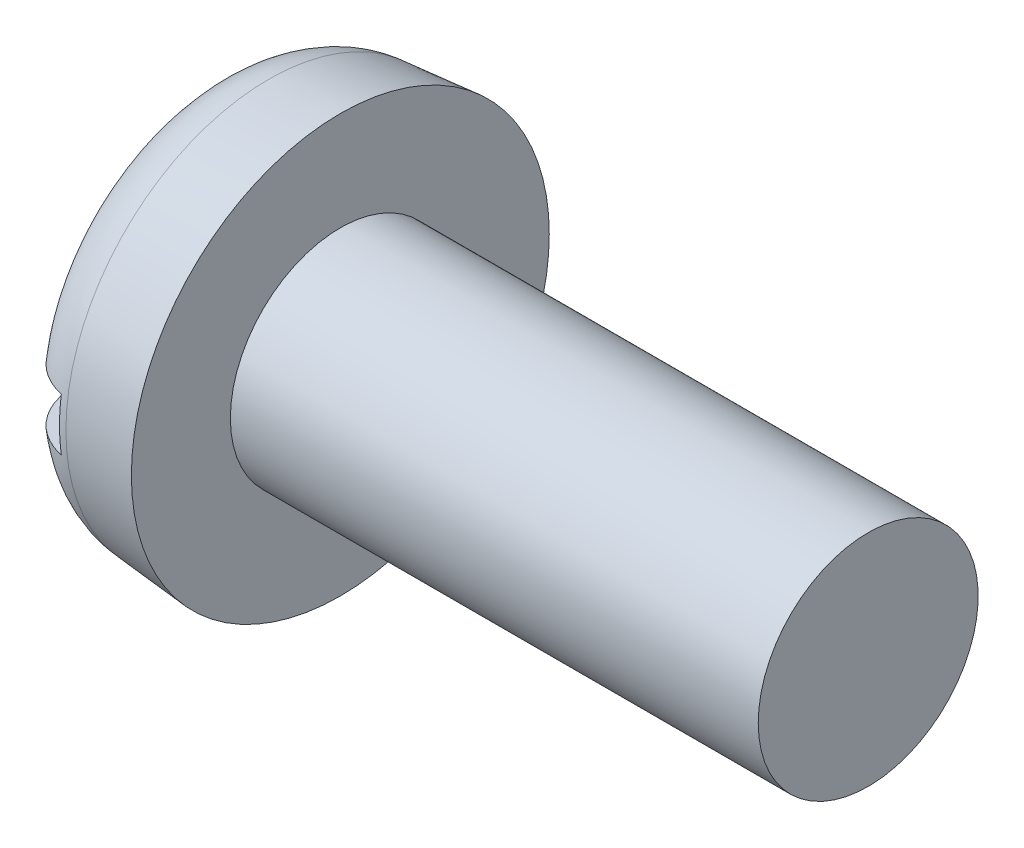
from build123d import *

# Parameters (mm, degrees)
FILLET2_R  = 1.5
SKETCH2_W  = 9.5
SKETCH2_H  = 1.2
SLOT_DEPTH = 1.2


with BuildPart() as part:
    # BodySke → Base-Revolve (revolve)
    with BuildSketch(Plane.XY, mode=Mode.PRIVATE) as base_revolve_sk:
        Polygon((3, 2.5), (3, 4.75), (0, 4.487534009), (0, 0), (15, 0), (15, 2.5), align=None)
    revolve(base_revolve_sk.sketch.rotate(Axis((-25.4, 0, 0), (1, 0, 0)), 90), axis=Axis((-25.4, 0, 0), (1, 0, 0)))

    # Fillet2
    fillet2_edges = [part.edges().sort_by_distance(p)[0] for p in [
        (0, 0, -4.487534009),
    ]]
    fillet(fillet2_edges, radius=FILLET2_R)

    # Sketch2 → Slot (cut)
    with BuildSketch(Plane(origin=(0, 0, 0), x_dir=(0, 0, -1), z_dir=(1, 0, 0))):
        Rectangle(SKETCH2_W, SKETCH2_H)
    extrude(amount=SLOT_DEPTH, mode=Mode.SUBTRACT)


solid = part.part
